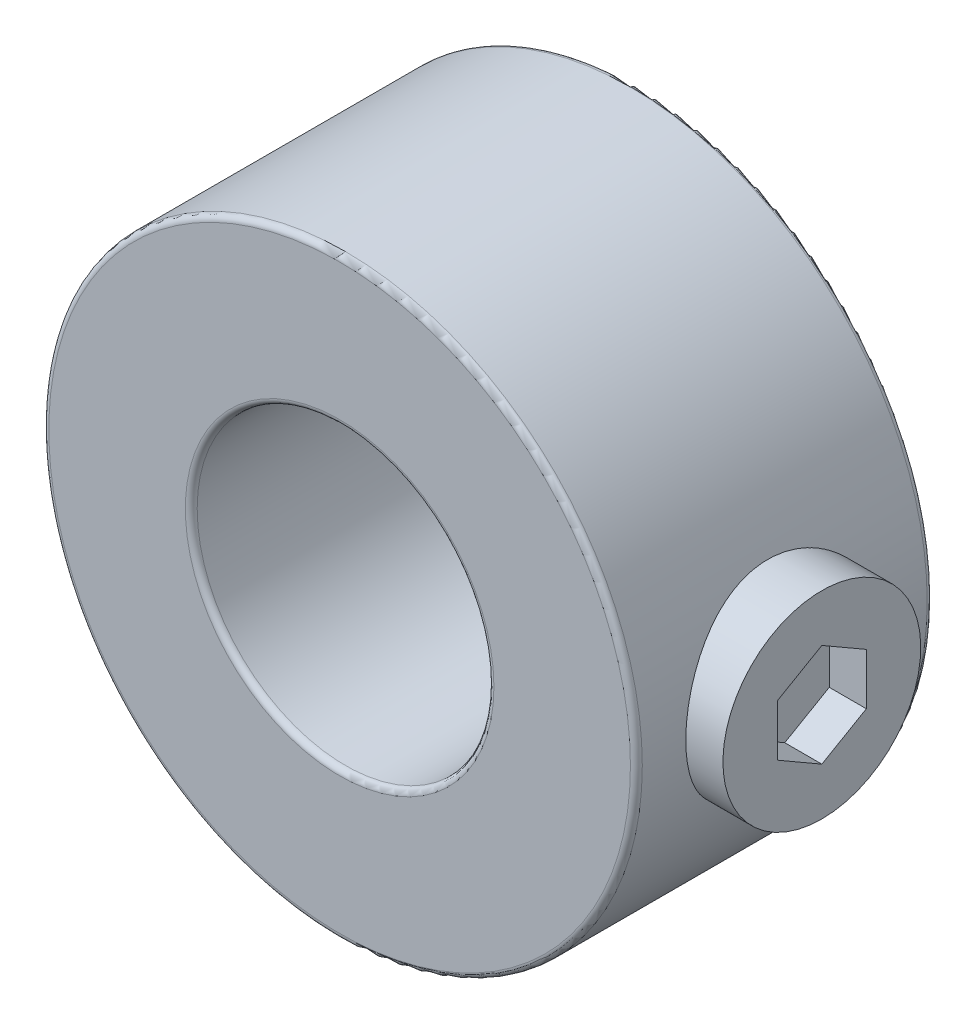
from build123d import *

# Parameters (mm, degrees)
SKETCH1_R               = 9.525
SKETCH1_R_2             = 4.7625
EXTRUDE1_DEPTH          = 9.525
CUT_EXTRUDE1_REACH      = 25.331
CUT_EXTRUDE1_END_RADIUS = 4.7625
SKETCH2_R               = 3.175
SKETCH3_W               = 4.7625
SKETCH3_H               = 3.175
CUT_EXTRUDE2_DEPTH      = 1.190625
FILLET1_R               = 0.1905


with BuildPart() as part:
    # Sketch1 → Extrude1 (new body)
    with BuildSketch(Plane.XY):
        with Locations(Location((0, 0, 0), (0, 0, 180))):
            Circle(SKETCH1_R)
        with Locations(Location((0, 0, 0), (0, 0, 180))):
            Circle(SKETCH1_R_2, mode=Mode.SUBTRACT)
    extrude(amount=EXTRUDE1_DEPTH)

    # Cut-Extrude1: up to this cylinder (the profile starts outside it)
    cut_extrude1_end = Plane(origin=(0, 0, 4.7625), z_dir=(0, 0, -1)) * Cylinder(CUT_EXTRUDE1_END_RADIUS, 61.187, mode=Mode.PRIVATE)
    # Sketch2 → Cut-Extrude1 (cut, up to the surface)
    with BuildSketch(Plane(origin=(9.525, 0, 0), x_dir=(0, 0, -1), z_dir=(1, 0, 0)), mode=Mode.PRIVATE) as cut_extrude1_sk1:
        with Locations((-4.7625, 0)):
            Circle(SKETCH2_R)
    cut_extrude1_tool1 = extrude(cut_extrude1_sk1.sketch, amount=-CUT_EXTRUDE1_REACH, mode=Mode.PRIVATE) - cut_extrude1_end
    add(cut_extrude1_tool1.solids().sort_by_distance((9.525, 0, 4.7625))[0], mode=Mode.SUBTRACT)

    # Fillet1
    fillet1_edges = [part.edges().sort_by_distance(p)[0] for p in [
        (9.525, 0, 0),
        (9.525, 0, 9.525),
        (4.7625, 0, 0),
        (4.7625, 0, 9.525),
    ]]
    fillet(fillet1_edges, radius=FILLET1_R)


with BuildPart() as body_2:
    # Sketch3 → Revolve1 (revolve)
    with BuildSketch(Plane.XY.offset(4.7625), mode=Mode.PRIVATE) as revolve1_sk:
        with Locations((8.334375, 1.5875)):
            Rectangle(SKETCH3_W, SKETCH3_H)
    revolve(revolve1_sk.sketch.rotate(Axis((5.953125, 0, 4.7625), (1, 0, 0)), 180), axis=Axis((5.953125, 0, 4.7625), (1, 0, 0)))

    # Sketch4 → Cut-Extrude2 (cut)
    with BuildSketch(Plane(origin=(10.715625, 0, 0), x_dir=(0, 0, -1), z_dir=(1, 0, 0))):
        Polygon((-4.7625, 1.649778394), (-6.19125, 0.824889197), (-6.19125, -0.824889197), (-4.7625, -1.649778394), (-3.33375, -0.824889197), (-3.33375, 0.824889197), align=None)
    extrude(amount=-CUT_EXTRUDE2_DEPTH, mode=Mode.SUBTRACT)


solid = Compound([part.part, body_2.part])
